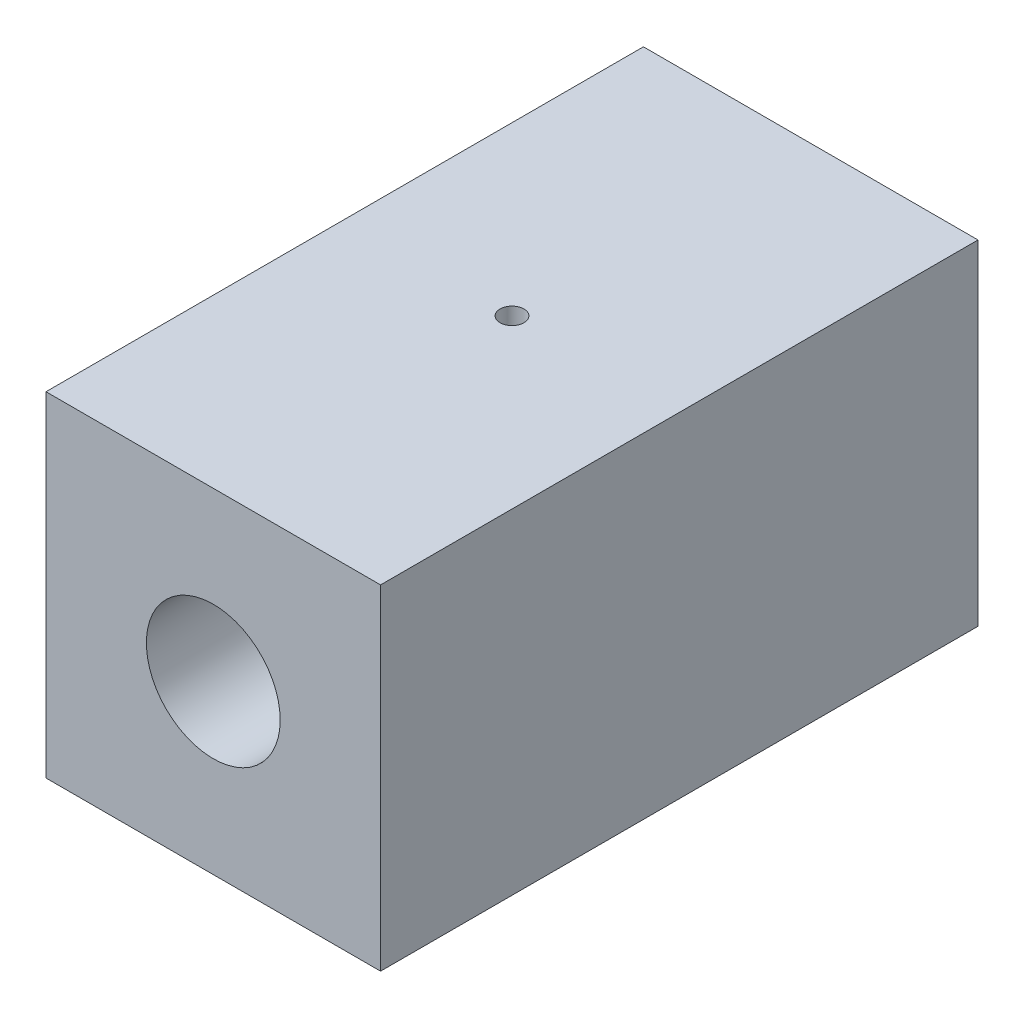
from build123d import *

# Parameters (mm, degrees)
ESQUISSE1_W             = 70
ESQUISSE1_H             = 70
ESQUISSE1_R             = 14
BASE_EXTRUSION_DEPTH    = 125
ESQUISSE2_R             = 2.5
ENL_V_MAT_EXTRU_1_DEPTH = 35


with BuildPart() as part:
    # Esquisse1 → Base-Extrusion (new body)
    with BuildSketch(Plane.XY):
        with Locations((35, -35)):
            Rectangle(ESQUISSE1_W, ESQUISSE1_H)
        with Locations((35, -35)):
            Circle(ESQUISSE1_R, mode=Mode.SUBTRACT)
    extrude(amount=BASE_EXTRUSION_DEPTH)

    # Esquisse2 → Enl_v. mat.-Extru.1 (cut)
    with BuildSketch(Plane(origin=(0, 0, 0), x_dir=(-1, 0, 0), z_dir=(0, 1, 0))):
        with Locations(Location((-35, 62.5, 0), (0, 0, 90))):
            Circle(ESQUISSE2_R)
    extrude(amount=-ENL_V_MAT_EXTRU_1_DEPTH, mode=Mode.SUBTRACT)


solid = part.part
